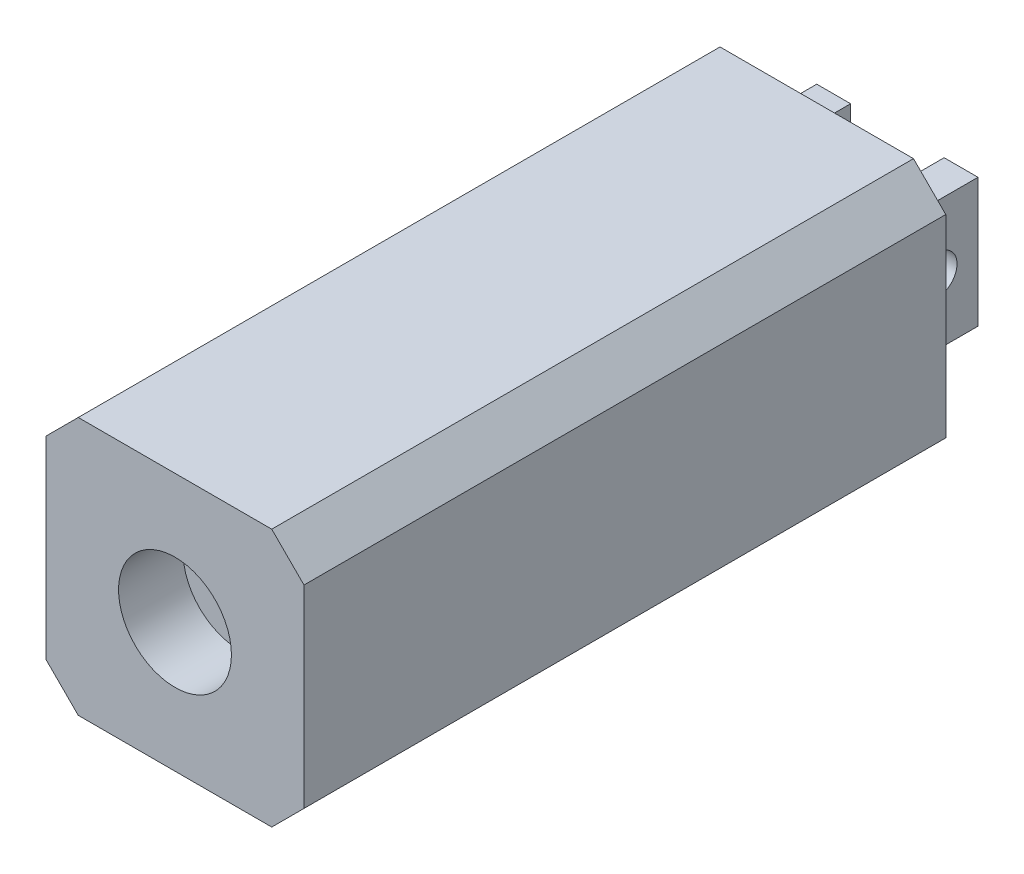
from build123d import *

# Parameters (mm, degrees)
ESQUISSE1_W             = 80
ESQUISSE1_H             = 80
BASE_EXTRUSION_DEPTH    = 199
CHANFREIN1_SIZE         = 10
ESQUISSE2_R             = 17.5
ENL_V_MAT_EXTRU_1_DEPTH = 20
ESQUISSE3_W             = 50
ESQUISSE3_H             = 40
BOSS_EXTRU_1_DEPTH      = 25
ESQUISSE4_W             = 29
ESQUISSE4_H             = 40
ENL_V_MAT_EXTRU_2_DEPTH = 25
ESQUISSE5_R             = 6
ENL_V_MAT_EXTRU_3_DEPTH = 225.111579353


with BuildPart() as part:
    # Esquisse1 → Base-Extrusion (new body)
    with BuildSketch(Plane.XY):
        with Locations((40, 40)):
            Rectangle(ESQUISSE1_W, ESQUISSE1_H)
    extrude(amount=BASE_EXTRUSION_DEPTH)

    # Chanfrein1
    chanfrein1_edges = [part.edges().sort_by_distance(p)[0] for p in [
        (0, 0, 99.5),
        (80, 0, 99.5),
        (80, 80, 99.5),
        (0, 80, 99.5),
    ]]
    chamfer(chanfrein1_edges, length=CHANFREIN1_SIZE)

    # Esquisse2 → Enl_v. mat.-Extru.1 (cut)
    with BuildSketch(Plane.XY.offset(199)):
        with Locations((40, 40)):
            Circle(ESQUISSE2_R)
    extrude(amount=-ENL_V_MAT_EXTRU_1_DEPTH, mode=Mode.SUBTRACT)

    # Esquisse3 → Boss.-Extru.1 (add)
    with BuildSketch(Plane(origin=(0, 0, 0), x_dir=(-1, 0, 0), z_dir=(0, 0, -1))):
        with Locations((-40, 40)):
            Rectangle(ESQUISSE3_W, ESQUISSE3_H)
    extrude(amount=BOSS_EXTRU_1_DEPTH)

    # Esquisse4 → Enl_v. mat.-Extru.2 (cut)
    with BuildSketch(Plane(origin=(0, 0, -25), x_dir=(-1, 0, 0), z_dir=(0, 0, -1))):
        with Locations((-40, 40)):
            Rectangle(ESQUISSE4_W, ESQUISSE4_H)
    extrude(amount=-ENL_V_MAT_EXTRU_2_DEPTH, mode=Mode.SUBTRACT)

    # Esquisse5 → Enl_v. mat.-Extru.3 (cut, through all)
    with BuildSketch(Plane.ZY.offset(-15)):
        with Locations((-12.5, 40)):
            Circle(ESQUISSE5_R)
    extrude(amount=-ENL_V_MAT_EXTRU_3_DEPTH, mode=Mode.SUBTRACT)


solid = part.part
